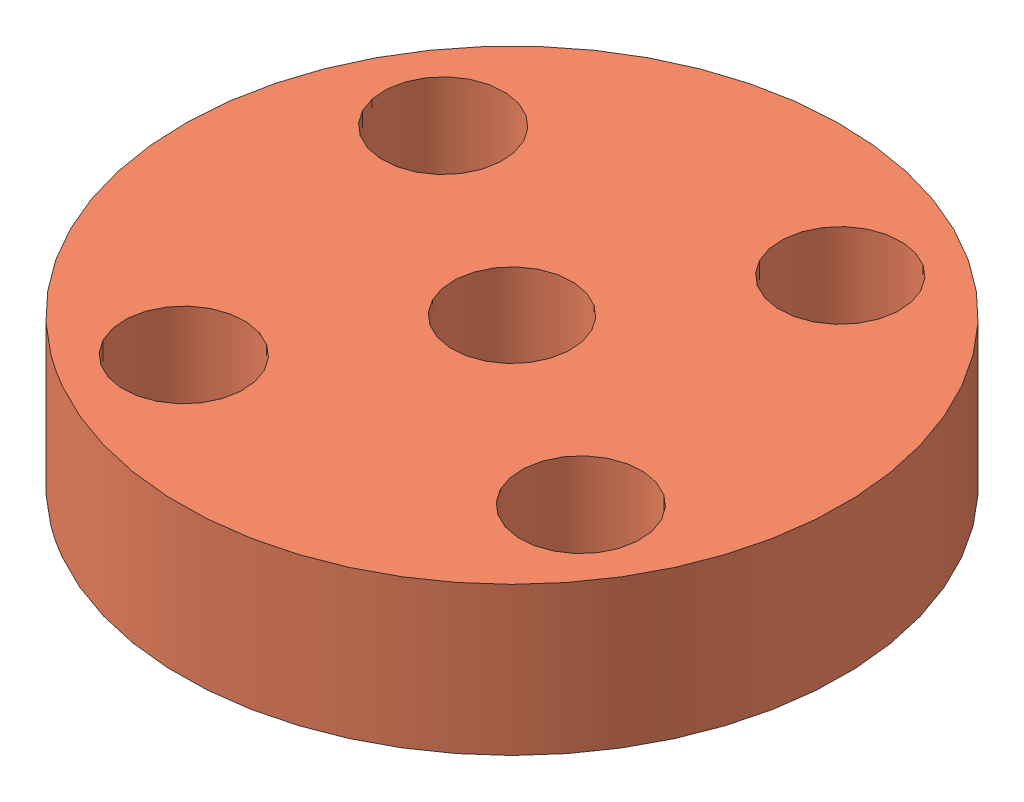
SolidWorks assembly 法.SLDASM, configuration 默认 (file format 10000). Lengths in mm.
Overall size (30.79 9 30.79).
2 component instances, 2 part files, 1 mates.
Components (placement in the parent):
- 法老你-1: 法老你.SLDPRT [默认] at (18.6123 16.7894 28.8956) size (7 4 7)
- 法兰轴2-2: 法兰轴2.SLDPRT [默认] at (-20.3439 25.7894 14.6838) x (-0.837169 0 -0.546944) z (-0.546944 0 0.837169) size (22.24 5 22.24)
Mates (geometry in assembly coordinates):
- 重合1: coincident anti-aligned: circle of 法老你-1; circle of 法兰轴2-2
